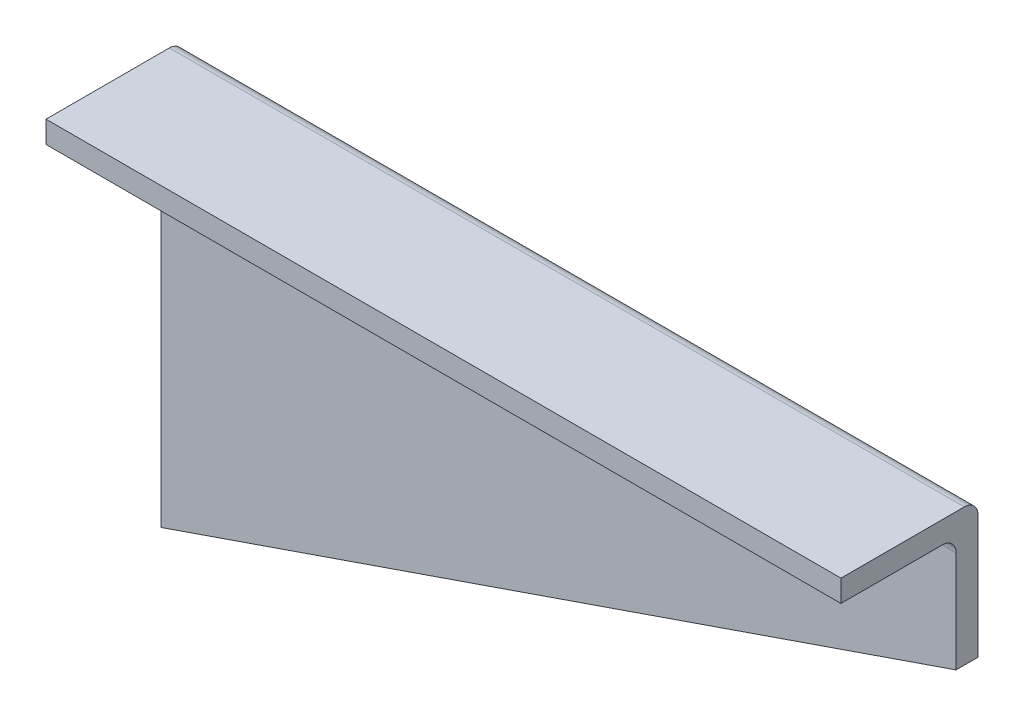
from build123d import *

# Parameters (mm, degrees)
EXTRUDE_1_DEPTH     = 8
SKETCH_2_W          = 290
SKETCH_2_H          = 8
EXTRUDE_2_DEPTH     = 42
SKETCH_3_R          = 6.5
CUT_EXTRUDE_1_DEPTH = 42
FILLET_1_R          = 5


with BuildPart() as part:
    # Sketch 1 → Extrude 1 (new body)
    with BuildSketch(Plane.XY):
        Polygon((0, 0), (0, -150), (290, -50), (290, 0), align=None)
    extrude(amount=EXTRUDE_1_DEPTH)

    # Sketch 2 → Extrude 2 (add)
    with BuildSketch(Plane.XY.offset(8)):
        with Locations((145, -4)):
            Rectangle(SKETCH_2_W, SKETCH_2_H)
    extrude(amount=EXTRUDE_2_DEPTH)

    # Sketch 3 → Cut-Extrude 1 (cut)
    with BuildSketch(Plane.XY.offset(8)):
        with Locations((250, -30)):
            Circle(SKETCH_3_R)
        with Locations((180, -30)):
            Circle(SKETCH_3_R)
    extrude(amount=-CUT_EXTRUDE_1_DEPTH, mode=Mode.SUBTRACT)

    # Fillet 1
    fillet_1_edges = [part.edges().sort_by_distance(p)[0] for p in [
        (145, -8, 8),
        (145, 0, 0),
    ]]
    fillet(fillet_1_edges, radius=FILLET_1_R)


solid = part.part
